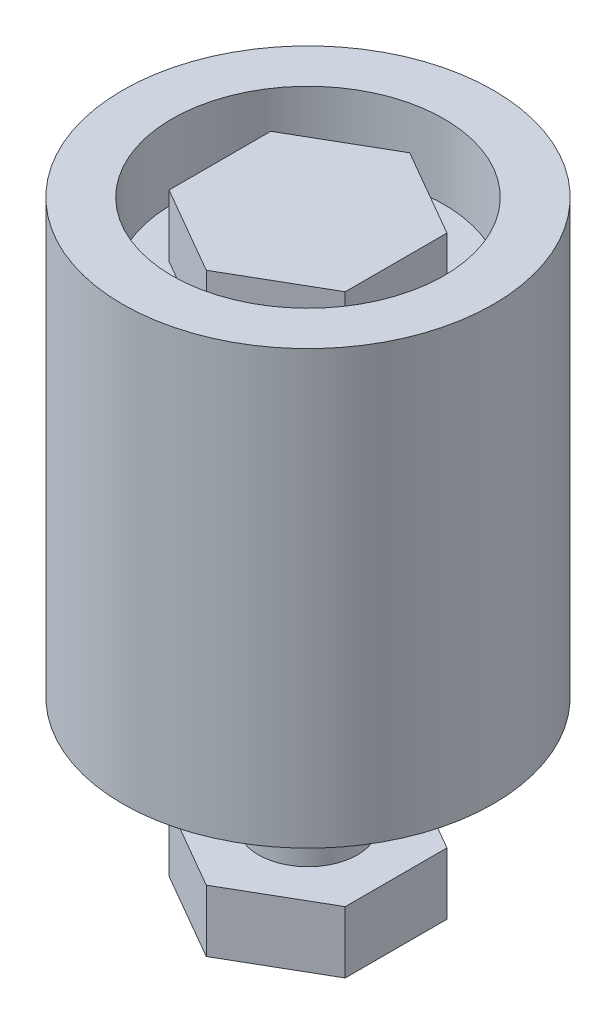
ISO-10303-21;
HEADER;
FILE_DESCRIPTION(('STEP AP214'),'2;1');
FILE_NAME('part.step','',(''),(''),'','','');
FILE_SCHEMA(('AUTOMOTIVE_DESIGN { 1 0 10303 214 1 1 1 1 }'));
ENDSEC;
DATA;
#1=APPLICATION_CONTEXT('core data for automotive mechanical design processes');
#2=APPLICATION_PROTOCOL_DEFINITION('international standard','automotive_design',2000,#1);
#3=PRODUCT_CONTEXT('',#1,'mechanical');
#4=PRODUCT('Part','Part','',(#3));
#5=PRODUCT_RELATED_PRODUCT_CATEGORY('part','',(#4));
#6=PRODUCT_DEFINITION_FORMATION('','',#4);
#7=PRODUCT_DEFINITION_CONTEXT('part definition',#1,'design');
#8=PRODUCT_DEFINITION('design','',#6,#7);
#9=PRODUCT_DEFINITION_SHAPE('','',#8);
#10=(LENGTH_UNIT() NAMED_UNIT(*) SI_UNIT(.MILLI.,.METRE.));
#11=(NAMED_UNIT(*) PLANE_ANGLE_UNIT() SI_UNIT($,.RADIAN.));
#12=(NAMED_UNIT(*) SI_UNIT($,.STERADIAN.) SOLID_ANGLE_UNIT());
#13=UNCERTAINTY_MEASURE_WITH_UNIT(LENGTH_MEASURE(1.E-05),#10,'distance_accuracy_value','');
#14=(GEOMETRIC_REPRESENTATION_CONTEXT(3) GLOBAL_UNCERTAINTY_ASSIGNED_CONTEXT((#13)) GLOBAL_UNIT_ASSIGNED_CONTEXT((#10,
#11,#12)) REPRESENTATION_CONTEXT('',''));
#15=CARTESIAN_POINT('',(0.,0.,0.));
#16=DIRECTION('',(0.,0.,1.));
#17=DIRECTION('',(1.,0.,0.));
#18=AXIS2_PLACEMENT_3D('',#15,#16,#17);
#19=CARTESIAN_POINT('',(0.,-11.080000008,0.));
#20=DIRECTION('',(0.,1.,0.));
#21=DIRECTION('',(0.,0.,1.));
#22=AXIS2_PLACEMENT_3D('',#19,#20,#21);
#23=CYLINDRICAL_SURFACE('',#22,4.);
#24=CARTESIAN_POINT('',(0.,0.,0.));
#25=DIRECTION('',(0.,1.,0.));
#26=DIRECTION('',(0.,0.,1.));
#27=AXIS2_PLACEMENT_3D('',#24,#25,#26);
#28=CIRCLE('',#27,4.);
#29=CARTESIAN_POINT('',(0.,0.,4.));
#30=VERTEX_POINT('',#29);
#31=EDGE_CURVE('E143',#30,#30,#28,.F.);
#32=ORIENTED_EDGE('',*,*,#31,.T.);
#33=EDGE_LOOP('',(#32));
#34=FACE_BOUND('',#33,.T.);
#35=CARTESIAN_POINT('',(0.,-6.08000000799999,0.));
#36=DIRECTION('',(0.,-1.,0.));
#37=DIRECTION('',(0.,0.,-1.));
#38=AXIS2_PLACEMENT_3D('',#35,#36,#37);
#39=CIRCLE('',#38,4.);
#40=CARTESIAN_POINT('',(0.,-6.08000000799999,-4.));
#41=VERTEX_POINT('',#40);
#42=EDGE_CURVE('E11',#41,#41,#39,.T.);
#43=ORIENTED_EDGE('',*,*,#42,.F.);
#44=EDGE_LOOP('',(#43));
#45=FACE_BOUND('',#44,.T.);
#46=ADVANCED_FACE('F34',(#34,#45),#23,.T.);
#47=CARTESIAN_POINT('',(0.,32.,0.));
#48=DIRECTION('',(0.,1.,0.));
#49=DIRECTION('',(0.,0.,1.));
#50=AXIS2_PLACEMENT_3D('',#47,#48,#49);
#51=PLANE('',#50);
#52=CARTESIAN_POINT('',(0.,32.,0.));
#53=DIRECTION('',(0.,1.,0.));
#54=DIRECTION('',(0.,0.,1.));
#55=AXIS2_PLACEMENT_3D('',#52,#53,#54);
#56=CIRCLE('',#55,11.);
#57=CARTESIAN_POINT('',(0.,32.,11.));
#58=VERTEX_POINT('',#57);
#59=EDGE_CURVE('E147',#58,#58,#56,.T.);
#60=ORIENTED_EDGE('',*,*,#59,.T.);
#61=EDGE_LOOP('',(#60));
#62=FACE_BOUND('',#61,.T.);
#63=DIRECTION('',(0.866025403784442,0.,0.499999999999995));
#64=VECTOR('',#63,1.);
#65=CARTESIAN_POINT('',(-3.56328176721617,32.,6.17178506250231));
#66=LINE('',#65,#64);
#67=CARTESIAN_POINT('',(-7.12656353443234,32.,4.11452337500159));
#68=VERTEX_POINT('',#67);
#69=CARTESIAN_POINT('',(0.,32.,8.22904675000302));
#70=VERTEX_POINT('',#69);
#71=EDGE_CURVE('E125',#68,#70,#66,.T.);
#72=ORIENTED_EDGE('',*,*,#71,.F.);
#73=DIRECTION('',(0.,0.,1.));
#74=VECTOR('',#73,1.);
#75=CARTESIAN_POINT('',(-7.12656353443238,32.,0.));
#76=LINE('',#75,#74);
#77=CARTESIAN_POINT('',(-7.12656353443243,32.,-4.11452337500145));
#78=VERTEX_POINT('',#77);
#79=EDGE_CURVE('E122',#78,#68,#76,.T.);
#80=ORIENTED_EDGE('',*,*,#79,.F.);
#81=DIRECTION('',(-0.866025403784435,0.,0.500000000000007));
#82=VECTOR('',#81,1.);
#83=CARTESIAN_POINT('',(-3.56328176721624,32.,-6.17178506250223));
#84=LINE('',#83,#82);
#85=CARTESIAN_POINT('',(0.,32.,-8.22904675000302));
#86=VERTEX_POINT('',#85);
#87=EDGE_CURVE('E78',#86,#78,#84,.T.);
#88=ORIENTED_EDGE('',*,*,#87,.F.);
#89=DIRECTION('',(-0.866025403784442,0.,-0.499999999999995));
#90=VECTOR('',#89,1.);
#91=CARTESIAN_POINT('',(3.56328176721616,32.,-6.17178506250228));
#92=LINE('',#91,#90);
#93=CARTESIAN_POINT('',(7.12656353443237,32.,-4.11452337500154));
#94=VERTEX_POINT('',#93);
#95=EDGE_CURVE('E131',#94,#86,#92,.T.);
#96=ORIENTED_EDGE('',*,*,#95,.F.);
#97=DIRECTION('',(0.,0.,-1.));
#98=VECTOR('',#97,1.);
#99=CARTESIAN_POINT('',(7.12656353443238,32.,0.));
#100=LINE('',#99,#98);
#101=CARTESIAN_POINT('',(7.1265635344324,32.,4.11452337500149));
#102=VERTEX_POINT('',#101);
#103=EDGE_CURVE('E111',#102,#94,#100,.T.);
#104=ORIENTED_EDGE('',*,*,#103,.F.);
#105=DIRECTION('',(0.866025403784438,0.,-0.500000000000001));
#106=VECTOR('',#105,1.);
#107=CARTESIAN_POINT('',(3.5632817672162,32.,6.17178506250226));
#108=LINE('',#107,#106);
#109=EDGE_CURVE('E128',#70,#102,#108,.T.);
#110=ORIENTED_EDGE('',*,*,#109,.F.);
#111=EDGE_LOOP('',(#72,#80,#88,#96,#104,#110));
#112=FACE_BOUND('',#111,.T.);
#113=ADVANCED_FACE('F167',(#62,#112),#51,.T.);
#114=CARTESIAN_POINT('',(0.,0.,0.));
#115=DIRECTION('',(0.,1.,0.));
#116=DIRECTION('',(0.,0.,1.));
#117=AXIS2_PLACEMENT_3D('',#114,#115,#116);
#118=PLANE('',#117);
#119=CARTESIAN_POINT('',(0.,0.,0.));
#120=DIRECTION('',(0.,1.,0.));
#121=DIRECTION('',(0.,0.,1.));
#122=AXIS2_PLACEMENT_3D('',#119,#120,#121);
#123=CIRCLE('',#122,6.);
#124=CARTESIAN_POINT('',(0.,0.,6.));
#125=VERTEX_POINT('',#124);
#126=EDGE_CURVE('E156',#125,#125,#123,.T.);
#127=ORIENTED_EDGE('',*,*,#126,.F.);
#128=EDGE_LOOP('',(#127));
#129=FACE_BOUND('',#128,.T.);
#130=ORIENTED_EDGE('',*,*,#31,.F.);
#131=EDGE_LOOP('',(#130));
#132=FACE_BOUND('',#131,.T.);
#133=ADVANCED_FACE('F164',(#129,#132),#118,.F.);
#134=CARTESIAN_POINT('',(0.,3.,0.));
#135=DIRECTION('',(0.,-1.,0.));
#136=DIRECTION('',(0.,0.,-1.));
#137=AXIS2_PLACEMENT_3D('',#134,#135,#136);
#138=CYLINDRICAL_SURFACE('',#137,6.);
#139=CARTESIAN_POINT('',(0.,3.,0.));
#140=DIRECTION('',(0.,1.,0.));
#141=DIRECTION('',(0.,0.,1.));
#142=AXIS2_PLACEMENT_3D('',#139,#140,#141);
#143=CIRCLE('',#142,6.);
#144=CARTESIAN_POINT('',(0.,3.,6.));
#145=VERTEX_POINT('',#144);
#146=EDGE_CURVE('E42',#145,#145,#143,.T.);
#147=ORIENTED_EDGE('',*,*,#146,.F.);
#148=EDGE_LOOP('',(#147));
#149=FACE_BOUND('',#148,.T.);
#150=ORIENTED_EDGE('',*,*,#126,.T.);
#151=EDGE_LOOP('',(#150));
#152=FACE_BOUND('',#151,.T.);
#153=ADVANCED_FACE('F36',(#149,#152),#138,.T.);
#154=CARTESIAN_POINT('',(0.,38.,0.));
#155=DIRECTION('',(0.,1.,0.));
#156=DIRECTION('',(0.,0.,1.));
#157=AXIS2_PLACEMENT_3D('',#154,#155,#156);
#158=PLANE('',#157);
#159=CARTESIAN_POINT('',(0.,38.,0.));
#160=DIRECTION('',(0.,1.,0.));
#161=DIRECTION('',(0.,0.,1.));
#162=AXIS2_PLACEMENT_3D('',#159,#160,#161);
#163=CIRCLE('',#162,11.);
#164=CARTESIAN_POINT('',(0.,38.,11.));
#165=VERTEX_POINT('',#164);
#166=EDGE_CURVE('E146',#165,#165,#163,.T.);
#167=ORIENTED_EDGE('',*,*,#166,.F.);
#168=EDGE_LOOP('',(#167));
#169=FACE_BOUND('',#168,.T.);
#170=CARTESIAN_POINT('',(0.,38.,0.));
#171=DIRECTION('',(0.,1.,0.));
#172=DIRECTION('',(0.,0.,1.));
#173=AXIS2_PLACEMENT_3D('',#170,#171,#172);
#174=CIRCLE('',#173,15.);
#175=CARTESIAN_POINT('',(0.,38.,15.));
#176=VERTEX_POINT('',#175);
#177=EDGE_CURVE('E153',#176,#176,#174,.T.);
#178=ORIENTED_EDGE('',*,*,#177,.T.);
#179=EDGE_LOOP('',(#178));
#180=FACE_BOUND('',#179,.T.);
#181=ADVANCED_FACE('F288',(#169,#180),#158,.T.);
#182=CARTESIAN_POINT('',(0.,3.,0.));
#183=DIRECTION('',(0.,1.,0.));
#184=DIRECTION('',(0.,0.,1.));
#185=AXIS2_PLACEMENT_3D('',#182,#183,#184);
#186=PLANE('',#185);
#187=ORIENTED_EDGE('',*,*,#146,.T.);
#188=EDGE_LOOP('',(#187));
#189=FACE_BOUND('',#188,.T.);
#190=CARTESIAN_POINT('',(0.,3.,0.));
#191=DIRECTION('',(0.,1.,0.));
#192=DIRECTION('',(0.,0.,1.));
#193=AXIS2_PLACEMENT_3D('',#190,#191,#192);
#194=CIRCLE('',#193,15.);
#195=CARTESIAN_POINT('',(0.,3.,15.));
#196=VERTEX_POINT('',#195);
#197=EDGE_CURVE('E150',#196,#196,#194,.T.);
#198=ORIENTED_EDGE('',*,*,#197,.F.);
#199=EDGE_LOOP('',(#198));
#200=FACE_BOUND('',#199,.T.);
#201=ADVANCED_FACE('F291',(#189,#200),#186,.F.);
#202=CARTESIAN_POINT('',(0.,38.,0.));
#203=DIRECTION('',(0.,-1.,0.));
#204=DIRECTION('',(0.,0.,-1.));
#205=AXIS2_PLACEMENT_3D('',#202,#203,#204);
#206=CYLINDRICAL_SURFACE('',#205,15.);
#207=ORIENTED_EDGE('',*,*,#177,.F.);
#208=EDGE_LOOP('',(#207));
#209=FACE_BOUND('',#208,.T.);
#210=ORIENTED_EDGE('',*,*,#197,.T.);
#211=EDGE_LOOP('',(#210));
#212=FACE_BOUND('',#211,.T.);
#213=ADVANCED_FACE('F286',(#209,#212),#206,.T.);
#214=CARTESIAN_POINT('',(0.,32.,0.));
#215=DIRECTION('',(0.,1.,0.));
#216=DIRECTION('',(0.,0.,1.));
#217=AXIS2_PLACEMENT_3D('',#214,#215,#216);
#218=CYLINDRICAL_SURFACE('',#217,11.);
#219=ORIENTED_EDGE('',*,*,#59,.F.);
#220=EDGE_LOOP('',(#219));
#221=FACE_BOUND('',#220,.T.);
#222=ORIENTED_EDGE('',*,*,#166,.T.);
#223=EDGE_LOOP('',(#222));
#224=FACE_BOUND('',#223,.T.);
#225=ADVANCED_FACE('F277',(#221,#224),#218,.F.);
#226=CARTESIAN_POINT('',(-7.12656353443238,37.,0.));
#227=DIRECTION('',(1.,0.,0.));
#228=DIRECTION('',(0.,0.,-1.));
#229=AXIS2_PLACEMENT_3D('',#226,#227,#228);
#230=PLANE('',#229);
#231=ORIENTED_EDGE('',*,*,#79,.T.);
#232=DIRECTION('',(0.,-1.,0.));
#233=VECTOR('',#232,1.);
#234=CARTESIAN_POINT('',(-7.12656353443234,37.,4.11452337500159));
#235=LINE('',#234,#233);
#236=CARTESIAN_POINT('',(-7.12656353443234,37.,4.11452337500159));
#237=VERTEX_POINT('',#236);
#238=EDGE_CURVE('E141',#237,#68,#235,.T.);
#239=ORIENTED_EDGE('',*,*,#238,.F.);
#240=DIRECTION('',(0.,0.,1.));
#241=VECTOR('',#240,1.);
#242=CARTESIAN_POINT('',(-7.12656353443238,37.,0.));
#243=LINE('',#242,#241);
#244=CARTESIAN_POINT('',(-7.12656353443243,37.,-4.11452337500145));
#245=VERTEX_POINT('',#244);
#246=EDGE_CURVE('E134',#245,#237,#243,.T.);
#247=ORIENTED_EDGE('',*,*,#246,.F.);
#248=DIRECTION('',(0.,-1.,0.));
#249=VECTOR('',#248,1.);
#250=CARTESIAN_POINT('',(-7.12656353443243,37.,-4.11452337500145));
#251=LINE('',#250,#249);
#252=EDGE_CURVE('E118',#245,#78,#251,.T.);
#253=ORIENTED_EDGE('',*,*,#252,.T.);
#254=EDGE_LOOP('',(#231,#239,#247,#253));
#255=FACE_BOUND('',#254,.T.);
#256=ADVANCED_FACE('F256',(#255),#230,.F.);
#257=CARTESIAN_POINT('',(-3.56328176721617,37.,6.17178506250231));
#258=DIRECTION('',(0.499999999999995,0.,-0.866025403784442));
#259=DIRECTION('',(-0.866025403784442,0.,-0.499999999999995));
#260=AXIS2_PLACEMENT_3D('',#257,#258,#259);
#261=PLANE('',#260);
#262=ORIENTED_EDGE('',*,*,#71,.T.);
#263=DIRECTION('',(0.,-1.,0.));
#264=VECTOR('',#263,1.);
#265=CARTESIAN_POINT('',(0.,37.,8.22904675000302));
#266=LINE('',#265,#264);
#267=CARTESIAN_POINT('',(0.,37.,8.22904675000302));
#268=VERTEX_POINT('',#267);
#269=EDGE_CURVE('E138',#268,#70,#266,.T.);
#270=ORIENTED_EDGE('',*,*,#269,.F.);
#271=DIRECTION('',(0.866025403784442,0.,0.499999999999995));
#272=VECTOR('',#271,1.);
#273=CARTESIAN_POINT('',(-3.56328176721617,37.,6.17178506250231));
#274=LINE('',#273,#272);
#275=EDGE_CURVE('E86',#237,#268,#274,.T.);
#276=ORIENTED_EDGE('',*,*,#275,.F.);
#277=ORIENTED_EDGE('',*,*,#238,.T.);
#278=EDGE_LOOP('',(#262,#270,#276,#277));
#279=FACE_BOUND('',#278,.T.);
#280=ADVANCED_FACE('F248',(#279),#261,.F.);
#281=CARTESIAN_POINT('',(3.5632817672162,37.,6.17178506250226));
#282=DIRECTION('',(-0.500000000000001,0.,-0.866025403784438));
#283=DIRECTION('',(-0.866025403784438,0.,0.500000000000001));
#284=AXIS2_PLACEMENT_3D('',#281,#282,#283);
#285=PLANE('',#284);
#286=ORIENTED_EDGE('',*,*,#109,.T.);
#287=DIRECTION('',(0.,-1.,0.));
#288=VECTOR('',#287,1.);
#289=CARTESIAN_POINT('',(7.1265635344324,37.,4.11452337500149));
#290=LINE('',#289,#288);
#291=CARTESIAN_POINT('',(7.1265635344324,37.,4.11452337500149));
#292=VERTEX_POINT('',#291);
#293=EDGE_CURVE('E114',#292,#102,#290,.T.);
#294=ORIENTED_EDGE('',*,*,#293,.F.);
#295=DIRECTION('',(0.866025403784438,0.,-0.500000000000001));
#296=VECTOR('',#295,1.);
#297=CARTESIAN_POINT('',(3.5632817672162,37.,6.17178506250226));
#298=LINE('',#297,#296);
#299=EDGE_CURVE('E102',#268,#292,#298,.T.);
#300=ORIENTED_EDGE('',*,*,#299,.F.);
#301=ORIENTED_EDGE('',*,*,#269,.T.);
#302=EDGE_LOOP('',(#286,#294,#300,#301));
#303=FACE_BOUND('',#302,.T.);
#304=ADVANCED_FACE('F252',(#303),#285,.F.);
#305=CARTESIAN_POINT('',(7.12656353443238,37.,0.));
#306=DIRECTION('',(-1.,0.,0.));
#307=DIRECTION('',(0.,0.,1.));
#308=AXIS2_PLACEMENT_3D('',#305,#306,#307);
#309=PLANE('',#308);
#310=ORIENTED_EDGE('',*,*,#103,.T.);
#311=DIRECTION('',(0.,-1.,0.));
#312=VECTOR('',#311,1.);
#313=CARTESIAN_POINT('',(7.12656353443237,37.,-4.11452337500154));
#314=LINE('',#313,#312);
#315=CARTESIAN_POINT('',(7.12656353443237,37.,-4.11452337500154));
#316=VERTEX_POINT('',#315);
#317=EDGE_CURVE('E108',#316,#94,#314,.T.);
#318=ORIENTED_EDGE('',*,*,#317,.F.);
#319=DIRECTION('',(0.,0.,-1.));
#320=VECTOR('',#319,1.);
#321=CARTESIAN_POINT('',(7.12656353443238,37.,0.));
#322=LINE('',#321,#320);
#323=EDGE_CURVE('E96',#292,#316,#322,.T.);
#324=ORIENTED_EDGE('',*,*,#323,.F.);
#325=ORIENTED_EDGE('',*,*,#293,.T.);
#326=EDGE_LOOP('',(#310,#318,#324,#325));
#327=FACE_BOUND('',#326,.T.);
#328=ADVANCED_FACE('F109',(#327),#309,.F.);
#329=CARTESIAN_POINT('',(3.56328176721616,37.,-6.17178506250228));
#330=DIRECTION('',(-0.499999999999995,0.,0.866025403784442));
#331=DIRECTION('',(0.866025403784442,0.,0.499999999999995));
#332=AXIS2_PLACEMENT_3D('',#329,#330,#331);
#333=PLANE('',#332);
#334=ORIENTED_EDGE('',*,*,#95,.T.);
#335=DIRECTION('',(0.,-1.,0.));
#336=VECTOR('',#335,1.);
#337=CARTESIAN_POINT('',(0.,37.,-8.22904675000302));
#338=LINE('',#337,#336);
#339=CARTESIAN_POINT('',(0.,37.,-8.22904675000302));
#340=VERTEX_POINT('',#339);
#341=EDGE_CURVE('E49',#340,#86,#338,.T.);
#342=ORIENTED_EDGE('',*,*,#341,.F.);
#343=DIRECTION('',(-0.866025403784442,0.,-0.499999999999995));
#344=VECTOR('',#343,1.);
#345=CARTESIAN_POINT('',(3.56328176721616,37.,-6.17178506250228));
#346=LINE('',#345,#344);
#347=EDGE_CURVE('E100',#316,#340,#346,.T.);
#348=ORIENTED_EDGE('',*,*,#347,.F.);
#349=ORIENTED_EDGE('',*,*,#317,.T.);
#350=EDGE_LOOP('',(#334,#342,#348,#349));
#351=FACE_BOUND('',#350,.T.);
#352=ADVANCED_FACE('F116',(#351),#333,.F.);
#353=CARTESIAN_POINT('',(-3.56328176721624,37.,-6.17178506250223));
#354=DIRECTION('',(0.500000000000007,0.,0.866025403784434));
#355=DIRECTION('',(0.866025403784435,0.,-0.500000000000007));
#356=AXIS2_PLACEMENT_3D('',#353,#354,#355);
#357=PLANE('',#356);
#358=ORIENTED_EDGE('',*,*,#87,.T.);
#359=ORIENTED_EDGE('',*,*,#252,.F.);
#360=DIRECTION('',(-0.866025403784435,0.,0.500000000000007));
#361=VECTOR('',#360,1.);
#362=CARTESIAN_POINT('',(-3.56328176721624,37.,-6.17178506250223));
#363=LINE('',#362,#361);
#364=EDGE_CURVE('E57',#340,#245,#363,.T.);
#365=ORIENTED_EDGE('',*,*,#364,.F.);
#366=ORIENTED_EDGE('',*,*,#341,.T.);
#367=EDGE_LOOP('',(#358,#359,#365,#366));
#368=FACE_BOUND('',#367,.T.);
#369=ADVANCED_FACE('F257',(#368),#357,.F.);
#370=CARTESIAN_POINT('',(0.,37.,0.));
#371=DIRECTION('',(0.,1.,0.));
#372=DIRECTION('',(0.,0.,1.));
#373=AXIS2_PLACEMENT_3D('',#370,#371,#372);
#374=PLANE('',#373);
#375=ORIENTED_EDGE('',*,*,#246,.T.);
#376=ORIENTED_EDGE('',*,*,#275,.T.);
#377=ORIENTED_EDGE('',*,*,#299,.T.);
#378=ORIENTED_EDGE('',*,*,#323,.T.);
#379=ORIENTED_EDGE('',*,*,#347,.T.);
#380=ORIENTED_EDGE('',*,*,#364,.T.);
#381=EDGE_LOOP('',(#375,#376,#377,#378,#379,#380));
#382=FACE_BOUND('',#381,.T.);
#383=ADVANCED_FACE('F98',(#382),#374,.T.);
#384=CARTESIAN_POINT('',(0.,-6.08000000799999,8.22904675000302));
#385=DIRECTION('',(-0.499999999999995,0.,0.866025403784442));
#386=DIRECTION('',(0.866025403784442,0.,0.499999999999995));
#387=AXIS2_PLACEMENT_3D('',#384,#385,#386);
#388=PLANE('',#387);
#389=DIRECTION('',(-0.866025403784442,0.,-0.499999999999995));
#390=VECTOR('',#389,1.);
#391=CARTESIAN_POINT('',(0.,-11.080000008,8.22904675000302));
#392=LINE('',#391,#390);
#393=CARTESIAN_POINT('',(0.,-11.080000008,8.22904675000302));
#394=VERTEX_POINT('',#393);
#395=CARTESIAN_POINT('',(-7.12656353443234,-11.080000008,4.11452337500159));
#396=VERTEX_POINT('',#395);
#397=EDGE_CURVE('E218',#394,#396,#392,.T.);
#398=ORIENTED_EDGE('',*,*,#397,.F.);
#399=DIRECTION('',(0.,-1.,0.));
#400=VECTOR('',#399,1.);
#401=CARTESIAN_POINT('',(0.,-6.08000000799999,8.22904675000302));
#402=LINE('',#401,#400);
#403=CARTESIAN_POINT('',(0.,-6.08000000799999,8.22904675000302));
#404=VERTEX_POINT('',#403);
#405=EDGE_CURVE('E126',#404,#394,#402,.T.);
#406=ORIENTED_EDGE('',*,*,#405,.F.);
#407=DIRECTION('',(-0.866025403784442,0.,-0.499999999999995));
#408=VECTOR('',#407,1.);
#409=CARTESIAN_POINT('',(0.,-6.08000000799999,8.22904675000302));
#410=LINE('',#409,#408);
#411=CARTESIAN_POINT('',(-7.12656353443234,-6.08000000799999,4.11452337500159));
#412=VERTEX_POINT('',#411);
#413=EDGE_CURVE('E185',#404,#412,#410,.T.);
#414=ORIENTED_EDGE('',*,*,#413,.T.);
#415=DIRECTION('',(0.,-1.,0.));
#416=VECTOR('',#415,1.);
#417=CARTESIAN_POINT('',(-7.12656353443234,-6.08000000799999,4.11452337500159));
#418=LINE('',#417,#416);
#419=EDGE_CURVE('E209',#412,#396,#418,.T.);
#420=ORIENTED_EDGE('',*,*,#419,.T.);
#421=EDGE_LOOP('',(#398,#406,#414,#420));
#422=FACE_BOUND('',#421,.T.);
#423=ADVANCED_FACE('F264',(#422),#388,.T.);
#424=CARTESIAN_POINT('',(7.1265635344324,-6.08000000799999,4.11452337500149));
#425=DIRECTION('',(0.500000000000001,0.,0.866025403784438));
#426=DIRECTION('',(0.866025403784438,0.,-0.500000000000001));
#427=AXIS2_PLACEMENT_3D('',#424,#425,#426);
#428=PLANE('',#427);
#429=DIRECTION('',(-0.866025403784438,0.,0.500000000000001));
#430=VECTOR('',#429,1.);
#431=CARTESIAN_POINT('',(7.1265635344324,-11.080000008,4.11452337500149));
#432=LINE('',#431,#430);
#433=CARTESIAN_POINT('',(7.1265635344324,-11.080000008,4.11452337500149));
#434=VERTEX_POINT('',#433);
#435=EDGE_CURVE('E198',#434,#394,#432,.T.);
#436=ORIENTED_EDGE('',*,*,#435,.F.);
#437=DIRECTION('',(0.,-1.,0.));
#438=VECTOR('',#437,1.);
#439=CARTESIAN_POINT('',(7.1265635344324,-6.08000000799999,4.11452337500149));
#440=LINE('',#439,#438);
#441=CARTESIAN_POINT('',(7.1265635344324,-6.08000000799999,4.11452337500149));
#442=VERTEX_POINT('',#441);
#443=EDGE_CURVE('E207',#442,#434,#440,.T.);
#444=ORIENTED_EDGE('',*,*,#443,.F.);
#445=DIRECTION('',(-0.866025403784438,0.,0.500000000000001));
#446=VECTOR('',#445,1.);
#447=CARTESIAN_POINT('',(7.1265635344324,-6.08000000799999,4.11452337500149));
#448=LINE('',#447,#446);
#449=EDGE_CURVE('E189',#442,#404,#448,.T.);
#450=ORIENTED_EDGE('',*,*,#449,.T.);
#451=ORIENTED_EDGE('',*,*,#405,.T.);
#452=EDGE_LOOP('',(#436,#444,#450,#451));
#453=FACE_BOUND('',#452,.T.);
#454=ADVANCED_FACE('F204',(#453),#428,.T.);
#455=CARTESIAN_POINT('',(7.12656353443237,-6.08000000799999,-4.11452337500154));
#456=DIRECTION('',(1.,0.,0.));
#457=DIRECTION('',(0.,0.,-1.));
#458=AXIS2_PLACEMENT_3D('',#455,#456,#457);
#459=PLANE('',#458);
#460=DIRECTION('',(0.,0.,1.));
#461=VECTOR('',#460,1.);
#462=CARTESIAN_POINT('',(7.12656353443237,-11.080000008,-4.11452337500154));
#463=LINE('',#462,#461);
#464=CARTESIAN_POINT('',(7.12656353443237,-11.080000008,-4.11452337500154));
#465=VERTEX_POINT('',#464);
#466=EDGE_CURVE('E230',#465,#434,#463,.T.);
#467=ORIENTED_EDGE('',*,*,#466,.F.);
#468=DIRECTION('',(0.,-1.,0.));
#469=VECTOR('',#468,1.);
#470=CARTESIAN_POINT('',(7.12656353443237,-6.08000000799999,-4.11452337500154));
#471=LINE('',#470,#469);
#472=CARTESIAN_POINT('',(7.12656353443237,-6.08000000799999,-4.11452337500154));
#473=VERTEX_POINT('',#472);
#474=EDGE_CURVE('E237',#473,#465,#471,.T.);
#475=ORIENTED_EDGE('',*,*,#474,.F.);
#476=DIRECTION('',(0.,0.,1.));
#477=VECTOR('',#476,1.);
#478=CARTESIAN_POINT('',(7.12656353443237,-6.08000000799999,-4.11452337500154));
#479=LINE('',#478,#477);
#480=EDGE_CURVE('E210',#473,#442,#479,.T.);
#481=ORIENTED_EDGE('',*,*,#480,.T.);
#482=ORIENTED_EDGE('',*,*,#443,.T.);
#483=EDGE_LOOP('',(#467,#475,#481,#482));
#484=FACE_BOUND('',#483,.T.);
#485=ADVANCED_FACE('F366',(#484),#459,.T.);
#486=CARTESIAN_POINT('',(0.,-6.08000000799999,-8.22904675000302));
#487=DIRECTION('',(0.499999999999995,0.,-0.866025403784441));
#488=DIRECTION('',(-0.866025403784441,0.,-0.499999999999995));
#489=AXIS2_PLACEMENT_3D('',#486,#487,#488);
#490=PLANE('',#489);
#491=DIRECTION('',(0.866025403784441,0.,0.499999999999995));
#492=VECTOR('',#491,1.);
#493=CARTESIAN_POINT('',(0.,-11.080000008,-8.22904675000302));
#494=LINE('',#493,#492);
#495=CARTESIAN_POINT('',(0.,-11.080000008,-8.22904675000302));
#496=VERTEX_POINT('',#495);
#497=EDGE_CURVE('E227',#496,#465,#494,.T.);
#498=ORIENTED_EDGE('',*,*,#497,.F.);
#499=DIRECTION('',(0.,-1.,0.));
#500=VECTOR('',#499,1.);
#501=CARTESIAN_POINT('',(0.,-6.08000000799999,-8.22904675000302));
#502=LINE('',#501,#500);
#503=CARTESIAN_POINT('',(0.,-6.08000000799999,-8.22904675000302));
#504=VERTEX_POINT('',#503);
#505=EDGE_CURVE('E240',#504,#496,#502,.T.);
#506=ORIENTED_EDGE('',*,*,#505,.F.);
#507=DIRECTION('',(0.866025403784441,0.,0.499999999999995));
#508=VECTOR('',#507,1.);
#509=CARTESIAN_POINT('',(0.,-6.08000000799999,-8.22904675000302));
#510=LINE('',#509,#508);
#511=EDGE_CURVE('E214',#504,#473,#510,.T.);
#512=ORIENTED_EDGE('',*,*,#511,.T.);
#513=ORIENTED_EDGE('',*,*,#474,.T.);
#514=EDGE_LOOP('',(#498,#506,#512,#513));
#515=FACE_BOUND('',#514,.T.);
#516=ADVANCED_FACE('F375',(#515),#490,.T.);
#517=CARTESIAN_POINT('',(-7.12656353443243,-6.08000000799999,-4.11452337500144));
#518=DIRECTION('',(-0.500000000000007,0.,-0.866025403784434));
#519=DIRECTION('',(-0.866025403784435,0.,0.500000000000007));
#520=AXIS2_PLACEMENT_3D('',#517,#518,#519);
#521=PLANE('',#520);
#522=DIRECTION('',(0.866025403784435,0.,-0.500000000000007));
#523=VECTOR('',#522,1.);
#524=CARTESIAN_POINT('',(-7.12656353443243,-11.080000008,-4.11452337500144));
#525=LINE('',#524,#523);
#526=CARTESIAN_POINT('',(-7.12656353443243,-11.080000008,-4.11452337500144));
#527=VERTEX_POINT('',#526);
#528=EDGE_CURVE('E224',#527,#496,#525,.T.);
#529=ORIENTED_EDGE('',*,*,#528,.F.);
#530=DIRECTION('',(0.,-1.,0.));
#531=VECTOR('',#530,1.);
#532=CARTESIAN_POINT('',(-7.12656353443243,-6.08000000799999,-4.11452337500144));
#533=LINE('',#532,#531);
#534=CARTESIAN_POINT('',(-7.12656353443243,-6.08000000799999,-4.11452337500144));
#535=VERTEX_POINT('',#534);
#536=EDGE_CURVE('E212',#535,#527,#533,.T.);
#537=ORIENTED_EDGE('',*,*,#536,.F.);
#538=DIRECTION('',(0.866025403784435,0.,-0.500000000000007));
#539=VECTOR('',#538,1.);
#540=CARTESIAN_POINT('',(-7.12656353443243,-6.08000000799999,-4.11452337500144));
#541=LINE('',#540,#539);
#542=EDGE_CURVE('E492',#535,#504,#541,.T.);
#543=ORIENTED_EDGE('',*,*,#542,.T.);
#544=ORIENTED_EDGE('',*,*,#505,.T.);
#545=EDGE_LOOP('',(#529,#537,#543,#544));
#546=FACE_BOUND('',#545,.T.);
#547=ADVANCED_FACE('F385',(#546),#521,.T.);
#548=CARTESIAN_POINT('',(-7.12656353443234,-6.08000000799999,4.11452337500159));
#549=DIRECTION('',(-1.,0.,0.));
#550=DIRECTION('',(0.,0.,1.));
#551=AXIS2_PLACEMENT_3D('',#548,#549,#550);
#552=PLANE('',#551);
#553=DIRECTION('',(0.,0.,-1.));
#554=VECTOR('',#553,1.);
#555=CARTESIAN_POINT('',(-7.12656353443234,-11.080000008,4.11452337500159));
#556=LINE('',#555,#554);
#557=EDGE_CURVE('E221',#396,#527,#556,.T.);
#558=ORIENTED_EDGE('',*,*,#557,.F.);
#559=ORIENTED_EDGE('',*,*,#419,.F.);
#560=DIRECTION('',(0.,0.,-1.));
#561=VECTOR('',#560,1.);
#562=CARTESIAN_POINT('',(-7.12656353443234,-6.08000000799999,4.11452337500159));
#563=LINE('',#562,#561);
#564=EDGE_CURVE('E193',#412,#535,#563,.T.);
#565=ORIENTED_EDGE('',*,*,#564,.T.);
#566=ORIENTED_EDGE('',*,*,#536,.T.);
#567=EDGE_LOOP('',(#558,#559,#565,#566));
#568=FACE_BOUND('',#567,.T.);
#569=ADVANCED_FACE('F179',(#568),#552,.T.);
#570=CARTESIAN_POINT('',(0.,-6.08000000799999,0.));
#571=DIRECTION('',(0.,-1.,0.));
#572=DIRECTION('',(0.,0.,-1.));
#573=AXIS2_PLACEMENT_3D('',#570,#571,#572);
#574=PLANE('',#573);
#575=ORIENTED_EDGE('',*,*,#42,.T.);
#576=EDGE_LOOP('',(#575));
#577=FACE_BOUND('',#576,.T.);
#578=ORIENTED_EDGE('',*,*,#413,.F.);
#579=ORIENTED_EDGE('',*,*,#449,.F.);
#580=ORIENTED_EDGE('',*,*,#480,.F.);
#581=ORIENTED_EDGE('',*,*,#511,.F.);
#582=ORIENTED_EDGE('',*,*,#542,.F.);
#583=ORIENTED_EDGE('',*,*,#564,.F.);
#584=EDGE_LOOP('',(#578,#579,#580,#581,#582,#583));
#585=FACE_BOUND('',#584,.T.);
#586=ADVANCED_FACE('F175',(#577,#585),#574,.F.);
#587=CARTESIAN_POINT('',(0.,-11.080000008,0.));
#588=DIRECTION('',(0.,1.,0.));
#589=DIRECTION('',(0.,0.,1.));
#590=AXIS2_PLACEMENT_3D('',#587,#588,#589);
#591=PLANE('',#590);
#592=ORIENTED_EDGE('',*,*,#397,.T.);
#593=ORIENTED_EDGE('',*,*,#557,.T.);
#594=ORIENTED_EDGE('',*,*,#528,.T.);
#595=ORIENTED_EDGE('',*,*,#497,.T.);
#596=ORIENTED_EDGE('',*,*,#466,.T.);
#597=ORIENTED_EDGE('',*,*,#435,.T.);
#598=EDGE_LOOP('',(#592,#593,#594,#595,#596,#597));
#599=FACE_BOUND('',#598,.T.);
#600=ADVANCED_FACE('F178',(#599),#591,.F.);
#601=CLOSED_SHELL('',(#46,#113,#133,#153,#181,#201,#213,#225,#256,#280,#304,#328,#352,#369,#383,
#423,#454,#485,#516,#547,#569,#586,#600));
#602=MANIFOLD_SOLID_BREP('B2',#601);
#603=ADVANCED_BREP_SHAPE_REPRESENTATION('',(#18,#602),#14);
#604=SHAPE_DEFINITION_REPRESENTATION(#9,#603);
ENDSEC;
END-ISO-10303-21;
